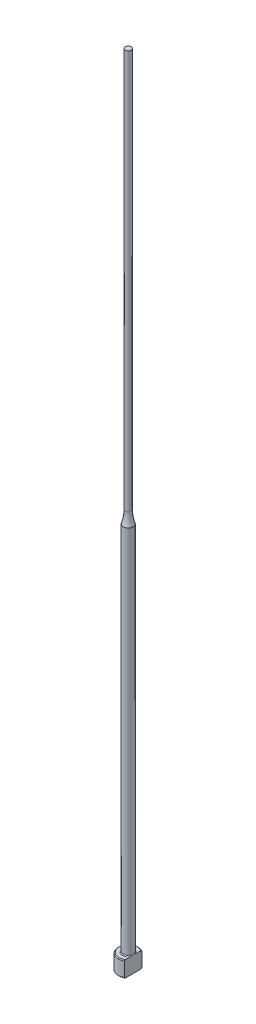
from build123d import *
from build123d.topology import SkipClean

# Parameters (mm, degrees)
CHAMFER1_SIZE    = 0.2
FILLET1_R        = 0.2
KEYED_HEAD_DEPTH = 201.031247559


with BuildPart() as part:
    # Sketch1 → Revolve1 (revolve)
    with BuildSketch(Plane.XY, mode=Mode.PRIVATE) as revolve1_sk:
        with BuildLine():
            Line((0, 0), (-2.5, 0))
            Line((-2.5, 0), (-2.5, 4))
            Line((-2.5, 4), (-1.25, 4))
            Line((-1.25, 4), (-1.25, 96.877501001))
            ThreePointArc((-1.25, 96.877501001), (-0.875791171, 98.41886117), (-0.75, 100))
            Line((-0.75, 100), (-0.75, 200))
            Line((-0.75, 200), (0, 200))
            Line((0, 200), (0, 0))
        make_face()
    revolve(revolve1_sk.sketch.rotate(Axis((0, 259.958771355, 0), (0, -1, 0)), 270), axis=Axis((0, 259.958771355, 0), (0, -1, 0)))

    # Chamfer1
    chamfer1_edges = [part.edges().sort_by_distance(p)[0] for p in [
        (0, 0, -2.5),
        (0, 4, -2.5),
    ]]
    chamfer(chamfer1_edges, length=CHAMFER1_SIZE)

    # Fillet1
    fillet1_edges = [part.edges().sort_by_distance(p)[0] for p in [
        (0, 4, -1.25),
    ]]
    fillet(fillet1_edges, radius=FILLET1_R)

    # Sketch2 → Keyed Head (cut, through all)
    with SkipClean():  # the faces are left unmerged after this step: merging them gives an invalid solid
        with BuildSketch(Plane(origin=(0, 0, 0), x_dir=(1, 0, 0), z_dir=(0, 1, 0))):
            with BuildLine():
                Line((1.25, -2.165063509), (1.25, 2.165063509))
                ThreePointArc((1.25, 2.165063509), (2.5, 0), (1.25, -2.165063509))
            make_face()
        extrude(amount=KEYED_HEAD_DEPTH, mode=Mode.SUBTRACT)


solid = part.part
